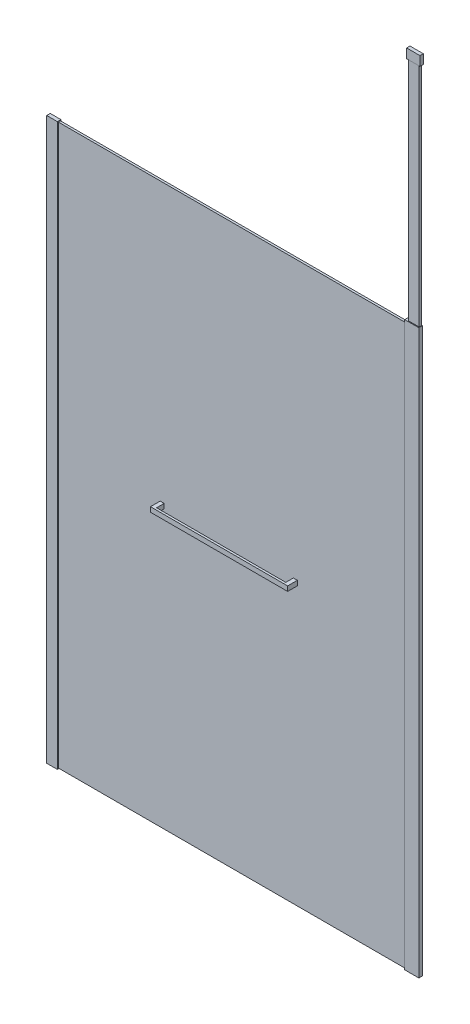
from build123d import *

# Parameters (mm, degrees)
DODANIE_WYCI_GNI_CIE1_START         = 3
DODANIE_WYCI_GNI_CIE1_DEPTH         = 2100
SZKIC2_W                            = 1347
SZKIC2_H                            = 8
DODANIE_WYCI_GNI_CIE2_DEPTH         = 2100
DODANIE_WYCI_GNI_CIE3_DEPTH         = 2108
SZKIC4_W                            = 40
SZKIC4_H                            = 13.3
DODANIE_WYCI_GNI_CIE4_DEPTH         = 3
SZKIC5_W                            = 53
SZKIC5_H                            = 14
DODANIE_WYCI_GNI_CIE5_DEPTH         = 3
SZKIC6_W                            = 8.1
SZKIC6_H                            = 7.8
DODANIE_WYCI_GNI_CIE6_DEPTH         = 15
SZKIC7_W                            = 53
SZKIC7_H                            = 14
DODANIE_WYCI_GNI_CIE7_DEPTH         = 3
SZKIC8_W                            = 40
SZKIC8_H                            = 13.3
DODANIE_WYCI_GNI_CIE8_DEPTH         = 3
SZKIC9_W                            = 40
SZKIC9_H                            = 8
DODANIE_WYCI_GNI_CIE9_DEPTH         = 883
DODANIE_WYCI_GNI_CIE10_START        = -32
SZKIC10_W                           = 50
SZKIC10_H                           = 12.5
DODANIE_WYCI_GNI_CIE10_DEPTH        = 35
DODANIE_WYCI_GNI_CIE11_DEPTH        = 36.5
DODANIE_WYCI_GNI_CIE11_DEPTH_BACK   = 18
SZKIC12_W                           = 15
SZKIC12_H                           = 18
DODANIE_WYCI_GNI_CIE11_2_DEPTH      = 36.5
DODANIE_WYCI_GNI_CIE11_2_DEPTH_BACK = 18
SZKIC13_W                           = 8
SZKIC13_H                           = 18
DODANIE_WYCI_GNI_CIE12_DEPTH        = 485


with BuildPart() as part:
    # Szkic1 → Dodanie-wyci_gni_cie1 (new body)
    with BuildSketch(Plane(origin=(0, 0, 0), x_dir=(1, 0, 0), z_dir=(0, 1, 0)).offset(DODANIE_WYCI_GNI_CIE1_START)):
        Polygon((0, 0), (0, 13.3), (40, 13.3), (40, 11.4), (6.5, 11.4), (6.5, 3.4), (40, 3.4), (40, 0), align=None)
    extrude(amount=DODANIE_WYCI_GNI_CIE1_DEPTH)

    # Szkic4 → Dodanie-wyci_gni_cie4 (add)
    with BuildSketch(Plane(origin=(0, 2103, 0), x_dir=(1, 0, 0), z_dir=(0, 1, 0))):
        with Locations((20, 6.65)):
            Rectangle(SZKIC4_W, SZKIC4_H)
    extrude(amount=DODANIE_WYCI_GNI_CIE4_DEPTH)

    # Szkic8 → Dodanie-wyci_gni_cie8 (add)
    with BuildSketch(Plane.XZ.offset(-3)):
        with Locations((20, -6.65)):
            Rectangle(SZKIC8_W, SZKIC8_H)
    extrude(amount=DODANIE_WYCI_GNI_CIE8_DEPTH)


with BuildPart() as body_2:
    # Szkic2 → Dodanie-wyci_gni_cie2 (new body)
    with BuildSketch(Plane.XZ.offset(-3)):
        with Locations((680, -7.4)):
            Rectangle(SZKIC2_W, SZKIC2_H)
    extrude(amount=-DODANIE_WYCI_GNI_CIE2_DEPTH)


with BuildPart() as body_3:
    # Szkic3 → Dodanie-wyci_gni_cie3 (new body)
    with BuildSketch(Plane.XZ.offset(-3)):
        Polygon((1343.4, -3.4), (1343.4, -0.4), (1396.4, -0.4), (1396.4, -14.4), (1343.4, -14.4), (1343.4, -11.4), (1353.5, -11.4), (1353.5, -3.4), align=None)
    extrude(amount=-DODANIE_WYCI_GNI_CIE3_DEPTH)

    # Szkic5 → Dodanie-wyci_gni_cie5 (add)
    with BuildSketch(Plane(origin=(0, 2111, 0), x_dir=(1, 0, 0), z_dir=(0, 1, 0))):
        with Locations((1369.9, 7.4)):
            Rectangle(SZKIC5_W, SZKIC5_H)
    extrude(amount=DODANIE_WYCI_GNI_CIE5_DEPTH)

    # Szkic6 → Dodanie-wyci_gni_cie6 (add)
    with BuildSketch(Plane.ZY.offset(-1343.4)):
        with Locations((-7.4, 2107.1)):
            Rectangle(SZKIC6_W, SZKIC6_H)
    extrude(amount=-DODANIE_WYCI_GNI_CIE6_DEPTH)

    # Szkic7 → Dodanie-wyci_gni_cie7 (add)
    with BuildSketch(Plane.XZ.offset(-3)):
        with Locations((1369.9, -7.4)):
            Rectangle(SZKIC7_W, SZKIC7_H)
    extrude(amount=DODANIE_WYCI_GNI_CIE7_DEPTH)


with BuildPart() as body_4:
    # Szkic9 → Dodanie-wyci_gni_cie9 (new body)
    with BuildSketch(Plane(origin=(0, 2114, 2099.6), x_dir=(-1, 0, 0), z_dir=(0, -1, 0))):
        with Locations((-1374.9, 2107)):
            Rectangle(SZKIC9_W, SZKIC9_H)
    extrude(amount=-DODANIE_WYCI_GNI_CIE9_DEPTH)

    # Szkic10 → Dodanie-wyci_gni_cie10 (add)
    with BuildSketch(Plane(origin=(0, 2997, 0), x_dir=(-1, 0, 0), z_dir=(0, 1, 0)).offset(DODANIE_WYCI_GNI_CIE10_START)):
        with Locations((-1374.9, -7.4)):
            Rectangle(SZKIC10_W, SZKIC10_H)
    extrude(amount=DODANIE_WYCI_GNI_CIE10_DEPTH)


with BuildPart() as body_5:
    # Szkic12 → Dodanie-wyci_gni_cie11 (new, two sides: drawn at the far end of the back side and taken through both)
    with BuildSketch(Plane.XY.offset(-3.4).offset(-DODANIE_WYCI_GNI_CIE11_DEPTH_BACK)):
        with Locations((430, 1053)):
            Rectangle(SZKIC12_W, SZKIC12_H)
    extrude(amount=DODANIE_WYCI_GNI_CIE11_DEPTH + DODANIE_WYCI_GNI_CIE11_DEPTH_BACK)



with BuildPart() as body_6:
    # Szkic12 → Dodanie-wyci_gni_cie11 2 (new, two sides: drawn at the far end of the back side and taken through both)
    with BuildSketch(Plane.XY.offset(-3.4).offset(-DODANIE_WYCI_GNI_CIE11_2_DEPTH_BACK)):
        with Locations((930, 1053)):
            Rectangle(SZKIC12_W, SZKIC12_H)
    extrude(amount=DODANIE_WYCI_GNI_CIE11_2_DEPTH + DODANIE_WYCI_GNI_CIE11_2_DEPTH_BACK)


with BuildPart() as body_5_1:
    add(body_5.part)

    add(body_6.part)  # Dodanie-wyci_gni_cie12 merges body 6
    # Szkic13 → Dodanie-wyci_gni_cie12 (add)
    with BuildSketch(Plane(origin=(437.5, 0, 0), x_dir=(0, 0, -1), z_dir=(1, 0, 0))):
        with Locations((-29.1, 1053)):
            Rectangle(SZKIC13_W, SZKIC13_H)
    extrude(amount=DODANIE_WYCI_GNI_CIE12_DEPTH)


solid = Compound([part.part, body_2.part, body_3.part, body_4.part, body_5_1.part])
